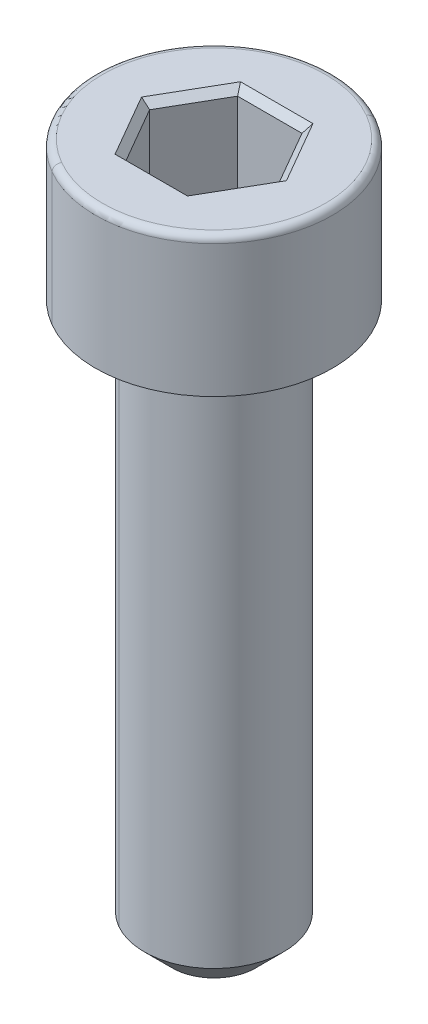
ISO-10303-21;
HEADER;
FILE_DESCRIPTION(('STEP AP214'),'2;1');
FILE_NAME('part.step','',(''),(''),'','','');
FILE_SCHEMA(('AUTOMOTIVE_DESIGN { 1 0 10303 214 1 1 1 1 }'));
ENDSEC;
DATA;
#1=APPLICATION_CONTEXT('core data for automotive mechanical design processes');
#2=APPLICATION_PROTOCOL_DEFINITION('international standard','automotive_design',2000,#1);
#3=PRODUCT_CONTEXT('',#1,'mechanical');
#4=PRODUCT('Part','Part','',(#3));
#5=PRODUCT_RELATED_PRODUCT_CATEGORY('part','',(#4));
#6=PRODUCT_DEFINITION_FORMATION('','',#4);
#7=PRODUCT_DEFINITION_CONTEXT('part definition',#1,'design');
#8=PRODUCT_DEFINITION('design','',#6,#7);
#9=PRODUCT_DEFINITION_SHAPE('','',#8);
#10=(LENGTH_UNIT() NAMED_UNIT(*) SI_UNIT(.MILLI.,.METRE.));
#11=(NAMED_UNIT(*) PLANE_ANGLE_UNIT() SI_UNIT($,.RADIAN.));
#12=(NAMED_UNIT(*) SI_UNIT($,.STERADIAN.) SOLID_ANGLE_UNIT());
#13=UNCERTAINTY_MEASURE_WITH_UNIT(LENGTH_MEASURE(1.E-05),#10,'distance_accuracy_value','');
#14=(GEOMETRIC_REPRESENTATION_CONTEXT(3) GLOBAL_UNCERTAINTY_ASSIGNED_CONTEXT((#13)) GLOBAL_UNIT_ASSIGNED_CONTEXT((#10,
#11,#12)) REPRESENTATION_CONTEXT('',''));
#15=CARTESIAN_POINT('',(0.,0.,0.));
#16=DIRECTION('',(0.,0.,1.));
#17=DIRECTION('',(1.,0.,0.));
#18=AXIS2_PLACEMENT_3D('',#15,#16,#17);
#19=CARTESIAN_POINT('',(-29.1547005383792,14.75,6.5));
#20=DIRECTION('',(-0.612372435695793,-0.70710678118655,-0.353553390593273));
#21=DIRECTION('',(-0.5,0.,0.866025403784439));
#22=AXIS2_PLACEMENT_3D('',#19,#20,#21);
#23=PLANE('',#22);
#24=DIRECTION('',(-0.377964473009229,0.654653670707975,-0.654653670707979));
#25=VECTOR('',#24,1.);
#26=CARTESIAN_POINT('',(-29.1547005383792,14.75,6.5));
#27=LINE('',#26,#25);
#28=CARTESIAN_POINT('',(-29.1547005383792,14.75,6.5));
#29=VERTEX_POINT('',#28);
#30=CARTESIAN_POINT('',(-29.2990381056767,15.,6.25));
#31=VERTEX_POINT('',#30);
#32=EDGE_CURVE('E25',#29,#31,#27,.T.);
#33=ORIENTED_EDGE('',*,*,#32,.T.);
#34=DIRECTION('',(0.5,0.,-0.866025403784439));
#35=VECTOR('',#34,1.);
#36=CARTESIAN_POINT('',(-29.948557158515,15.,7.375));
#37=LINE('',#36,#35);
#38=CARTESIAN_POINT('',(-30.5980762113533,15.,8.5));
#39=VERTEX_POINT('',#38);
#40=EDGE_CURVE('E237',#39,#31,#37,.T.);
#41=ORIENTED_EDGE('',*,*,#40,.F.);
#42=DIRECTION('',(0.755928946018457,-0.654653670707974,0.));
#43=VECTOR('',#42,1.);
#44=CARTESIAN_POINT('',(-29.6495721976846,14.1785714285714,8.5));
#45=LINE('',#44,#43);
#46=CARTESIAN_POINT('',(-30.3094010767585,14.75,8.5));
#47=VERTEX_POINT('',#46);
#48=EDGE_CURVE('E11',#39,#47,#45,.T.);
#49=ORIENTED_EDGE('',*,*,#48,.T.);
#50=DIRECTION('',(-0.5,0.,0.866025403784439));
#51=VECTOR('',#50,1.);
#52=CARTESIAN_POINT('',(-29.1547005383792,14.75,6.5));
#53=LINE('',#52,#51);
#54=EDGE_CURVE('E266',#29,#47,#53,.T.);
#55=ORIENTED_EDGE('',*,*,#54,.F.);
#56=EDGE_LOOP('',(#33,#41,#49,#55));
#57=FACE_BOUND('',#56,.T.);
#58=ADVANCED_FACE('F16',(#57),#23,.F.);
#59=CARTESIAN_POINT('',(-30.3094010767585,14.75,8.5));
#60=DIRECTION('',(-0.612372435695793,-0.70710678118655,0.353553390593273));
#61=DIRECTION('',(0.5,0.,0.866025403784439));
#62=AXIS2_PLACEMENT_3D('',#59,#60,#61);
#63=PLANE('',#62);
#64=DIRECTION('',(0.377964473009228,-0.654653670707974,-0.65465367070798));
#65=VECTOR('',#64,1.);
#66=CARTESIAN_POINT('',(-29.1547005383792,14.75,10.5));
#67=LINE('',#66,#65);
#68=CARTESIAN_POINT('',(-29.2990381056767,15.,10.75));
#69=VERTEX_POINT('',#68);
#70=CARTESIAN_POINT('',(-29.1547005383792,14.75,10.5));
#71=VERTEX_POINT('',#70);
#72=EDGE_CURVE('E284',#69,#71,#67,.T.);
#73=ORIENTED_EDGE('',*,*,#72,.T.);
#74=DIRECTION('',(0.5,0.,0.866025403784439));
#75=VECTOR('',#74,1.);
#76=CARTESIAN_POINT('',(-30.3094010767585,14.75,8.5));
#77=LINE('',#76,#75);
#78=EDGE_CURVE('E326',#47,#71,#77,.T.);
#79=ORIENTED_EDGE('',*,*,#78,.F.);
#80=ORIENTED_EDGE('',*,*,#48,.F.);
#81=DIRECTION('',(-0.5,0.,-0.866025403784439));
#82=VECTOR('',#81,1.);
#83=CARTESIAN_POINT('',(-29.948557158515,15.,9.625));
#84=LINE('',#83,#82);
#85=EDGE_CURVE('E233',#69,#39,#84,.T.);
#86=ORIENTED_EDGE('',*,*,#85,.F.);
#87=EDGE_LOOP('',(#73,#79,#80,#86));
#88=FACE_BOUND('',#87,.T.);
#89=ADVANCED_FACE('F354',(#88),#63,.F.);
#90=CARTESIAN_POINT('',(-26.8452994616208,14.75,6.5));
#91=DIRECTION('',(0.,-0.70710678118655,-0.707106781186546));
#92=DIRECTION('',(-1.,0.,0.));
#93=AXIS2_PLACEMENT_3D('',#90,#91,#92);
#94=PLANE('',#93);
#95=DIRECTION('',(0.377964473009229,0.654653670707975,-0.654653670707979));
#96=VECTOR('',#95,1.);
#97=CARTESIAN_POINT('',(-26.8452994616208,14.75,6.5));
#98=LINE('',#97,#96);
#99=CARTESIAN_POINT('',(-26.8452994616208,14.75,6.5));
#100=VERTEX_POINT('',#99);
#101=CARTESIAN_POINT('',(-26.7009618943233,15.,6.25));
#102=VERTEX_POINT('',#101);
#103=EDGE_CURVE('E277',#100,#102,#98,.T.);
#104=ORIENTED_EDGE('',*,*,#103,.T.);
#105=DIRECTION('',(1.,0.,0.));
#106=VECTOR('',#105,1.);
#107=CARTESIAN_POINT('',(-28.,15.,6.25));
#108=LINE('',#107,#106);
#109=EDGE_CURVE('E241',#31,#102,#108,.T.);
#110=ORIENTED_EDGE('',*,*,#109,.F.);
#111=ORIENTED_EDGE('',*,*,#32,.F.);
#112=DIRECTION('',(-1.,0.,0.));
#113=VECTOR('',#112,1.);
#114=CARTESIAN_POINT('',(-26.8452994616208,14.75,6.5));
#115=LINE('',#114,#113);
#116=EDGE_CURVE('E288',#100,#29,#115,.T.);
#117=ORIENTED_EDGE('',*,*,#116,.F.);
#118=EDGE_LOOP('',(#104,#110,#111,#117));
#119=FACE_BOUND('',#118,.T.);
#120=ADVANCED_FACE('F359',(#119),#94,.F.);
#121=CARTESIAN_POINT('',(-29.1547005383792,14.75,10.5));
#122=DIRECTION('',(0.,-0.70710678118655,0.707106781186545));
#123=DIRECTION('',(1.,0.,0.));
#124=AXIS2_PLACEMENT_3D('',#121,#122,#123);
#125=PLANE('',#124);
#126=DIRECTION('',(-0.377964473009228,-0.654653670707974,-0.654653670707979));
#127=VECTOR('',#126,1.);
#128=CARTESIAN_POINT('',(-26.8452994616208,14.75,10.5));
#129=LINE('',#128,#127);
#130=CARTESIAN_POINT('',(-26.7009618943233,15.,10.75));
#131=VERTEX_POINT('',#130);
#132=CARTESIAN_POINT('',(-26.8452994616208,14.75,10.5));
#133=VERTEX_POINT('',#132);
#134=EDGE_CURVE('E200',#131,#133,#129,.T.);
#135=ORIENTED_EDGE('',*,*,#134,.T.);
#136=DIRECTION('',(1.,0.,0.));
#137=VECTOR('',#136,1.);
#138=CARTESIAN_POINT('',(-29.1547005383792,14.75,10.5));
#139=LINE('',#138,#137);
#140=EDGE_CURVE('E318',#71,#133,#139,.T.);
#141=ORIENTED_EDGE('',*,*,#140,.F.);
#142=ORIENTED_EDGE('',*,*,#72,.F.);
#143=DIRECTION('',(-1.,0.,0.));
#144=VECTOR('',#143,1.);
#145=CARTESIAN_POINT('',(-28.,15.,10.75));
#146=LINE('',#145,#144);
#147=EDGE_CURVE('E252',#131,#69,#146,.T.);
#148=ORIENTED_EDGE('',*,*,#147,.F.);
#149=EDGE_LOOP('',(#135,#141,#142,#148));
#150=FACE_BOUND('',#149,.T.);
#151=ADVANCED_FACE('F553',(#150),#125,.F.);
#152=CARTESIAN_POINT('',(-25.6905989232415,14.75,8.5));
#153=DIRECTION('',(0.612372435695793,-0.70710678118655,-0.353553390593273));
#154=DIRECTION('',(-0.5,0.,-0.866025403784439));
#155=AXIS2_PLACEMENT_3D('',#152,#153,#154);
#156=PLANE('',#155);
#157=DIRECTION('',(0.755928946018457,0.654653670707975,0.));
#158=VECTOR('',#157,1.);
#159=CARTESIAN_POINT('',(-25.6905989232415,14.75,8.5));
#160=LINE('',#159,#158);
#161=CARTESIAN_POINT('',(-25.6905989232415,14.75,8.5));
#162=VERTEX_POINT('',#161);
#163=CARTESIAN_POINT('',(-25.4019237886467,15.,8.5));
#164=VERTEX_POINT('',#163);
#165=EDGE_CURVE('E206',#162,#164,#160,.T.);
#166=ORIENTED_EDGE('',*,*,#165,.T.);
#167=DIRECTION('',(0.5,0.,0.866025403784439));
#168=VECTOR('',#167,1.);
#169=CARTESIAN_POINT('',(-26.051442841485,15.,7.375));
#170=LINE('',#169,#168);
#171=EDGE_CURVE('E245',#102,#164,#170,.T.);
#172=ORIENTED_EDGE('',*,*,#171,.F.);
#173=ORIENTED_EDGE('',*,*,#103,.F.);
#174=DIRECTION('',(-0.5,0.,-0.866025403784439));
#175=VECTOR('',#174,1.);
#176=CARTESIAN_POINT('',(-25.6905989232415,14.75,8.5));
#177=LINE('',#176,#175);
#178=EDGE_CURVE('E297',#162,#100,#177,.T.);
#179=ORIENTED_EDGE('',*,*,#178,.F.);
#180=EDGE_LOOP('',(#166,#172,#173,#179));
#181=FACE_BOUND('',#180,.T.);
#182=ADVANCED_FACE('F350',(#181),#156,.F.);
#183=CARTESIAN_POINT('',(-26.8452994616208,14.75,10.5));
#184=DIRECTION('',(0.612372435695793,-0.70710678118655,0.353553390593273));
#185=DIRECTION('',(0.5,0.,-0.866025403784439));
#186=AXIS2_PLACEMENT_3D('',#183,#184,#185);
#187=PLANE('',#186);
#188=ORIENTED_EDGE('',*,*,#134,.F.);
#189=DIRECTION('',(-0.5,0.,0.866025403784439));
#190=VECTOR('',#189,1.);
#191=CARTESIAN_POINT('',(-26.051442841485,15.,9.625));
#192=LINE('',#191,#190);
#193=EDGE_CURVE('E249',#164,#131,#192,.T.);
#194=ORIENTED_EDGE('',*,*,#193,.F.);
#195=ORIENTED_EDGE('',*,*,#165,.F.);
#196=DIRECTION('',(0.5,0.,-0.866025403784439));
#197=VECTOR('',#196,1.);
#198=CARTESIAN_POINT('',(-26.8452994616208,14.75,10.5));
#199=LINE('',#198,#197);
#200=EDGE_CURVE('E309',#133,#162,#199,.T.);
#201=ORIENTED_EDGE('',*,*,#200,.F.);
#202=EDGE_LOOP('',(#188,#194,#195,#201));
#203=FACE_BOUND('',#202,.T.);
#204=ADVANCED_FACE('F342',(#203),#187,.F.);
#205=CARTESIAN_POINT('',(-27.0618058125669,11.75,6.625));
#206=DIRECTION('',(-0.5,0.,-0.866025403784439));
#207=DIRECTION('',(0.866025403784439,0.,-0.5));
#208=AXIS2_PLACEMENT_3D('',#205,#206,#207);
#209=CYLINDRICAL_SURFACE('',#208,0.25);
#210=CARTESIAN_POINT('',(-25.9792740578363,11.5,8.5));
#211=CARTESIAN_POINT('',(-25.8101720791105,11.5,8.5));
#212=CARTESIAN_POINT('',(-25.6905989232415,11.6035533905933,8.5));
#213=CARTESIAN_POINT('',(-25.6905989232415,11.75,8.5));
#214=(BOUNDED_CURVE() B_SPLINE_CURVE(3,(#210,#211,#212,#213),.UNSPECIFIED.,.F.,
.F.) B_SPLINE_CURVE_WITH_KNOTS((4,4),(1.5707963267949,3.1415926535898),
.UNSPECIFIED.) CURVE() GEOMETRIC_REPRESENTATION_ITEM() RATIONAL_B_SPLINE_CURVE((1.,
0.804737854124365,0.804737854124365,1.)) REPRESENTATION_ITEM(''));
#215=CARTESIAN_POINT('',(-25.9792740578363,11.5,8.5));
#216=VERTEX_POINT('',#215);
#217=CARTESIAN_POINT('',(-25.6905989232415,11.75,8.5));
#218=VERTEX_POINT('',#217);
#219=EDGE_CURVE('E136',#216,#218,#214,.T.);
#220=ORIENTED_EDGE('',*,*,#219,.T.);
#221=DIRECTION('',(0.5,0.,0.866025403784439));
#222=VECTOR('',#221,1.);
#223=CARTESIAN_POINT('',(-25.6905989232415,11.75,8.5));
#224=LINE('',#223,#222);
#225=CARTESIAN_POINT('',(-26.8452994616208,11.75,6.5));
#226=VERTEX_POINT('',#225);
#227=EDGE_CURVE('E301',#226,#218,#224,.T.);
#228=ORIENTED_EDGE('',*,*,#227,.F.);
#229=CARTESIAN_POINT('',(-26.8452994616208,11.75,6.5));
#230=CARTESIAN_POINT('',(-26.8452994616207,11.6035533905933,6.5));
#231=CARTESIAN_POINT('',(-26.9050860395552,11.5,6.60355339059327));
#232=CARTESIAN_POINT('',(-26.9896370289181,11.5,6.75));
#233=(BOUNDED_CURVE() B_SPLINE_CURVE(3,(#229,#230,#231,#232),.UNSPECIFIED.,.F.,
.F.) B_SPLINE_CURVE_WITH_KNOTS((4,4),(0.,1.5707963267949),
.UNSPECIFIED.) CURVE() GEOMETRIC_REPRESENTATION_ITEM() RATIONAL_B_SPLINE_CURVE((1.,
0.804737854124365,0.804737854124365,1.)) REPRESENTATION_ITEM(''));
#234=CARTESIAN_POINT('',(-26.9896370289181,11.5,6.75));
#235=VERTEX_POINT('',#234);
#236=EDGE_CURVE('E191',#226,#235,#233,.T.);
#237=ORIENTED_EDGE('',*,*,#236,.T.);
#238=DIRECTION('',(-0.5,0.,-0.866025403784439));
#239=VECTOR('',#238,1.);
#240=CARTESIAN_POINT('',(-27.0618058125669,11.5,6.625));
#241=LINE('',#240,#239);
#242=EDGE_CURVE('E151',#216,#235,#241,.T.);
#243=ORIENTED_EDGE('',*,*,#242,.F.);
#244=EDGE_LOOP('',(#220,#228,#237,#243));
#245=FACE_BOUND('',#244,.T.);
#246=ADVANCED_FACE('F340',(#245),#209,.F.);
#247=CARTESIAN_POINT('',(-30.3094010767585,11.75,6.75));
#248=DIRECTION('',(-1.,0.,0.));
#249=DIRECTION('',(0.,0.,-1.));
#250=AXIS2_PLACEMENT_3D('',#247,#248,#249);
#251=CYLINDRICAL_SURFACE('',#250,0.25);
#252=CARTESIAN_POINT('',(-29.1547005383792,11.75,6.5));
#253=CARTESIAN_POINT('',(-29.1547005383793,11.6035533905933,6.5));
#254=CARTESIAN_POINT('',(-29.0949139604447,11.5,6.60355339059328));
#255=CARTESIAN_POINT('',(-29.0103629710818,11.5,6.75));
#256=(BOUNDED_CURVE() B_SPLINE_CURVE(3,(#252,#253,#254,#255),.UNSPECIFIED.,.F.,
.F.) B_SPLINE_CURVE_WITH_KNOTS((4,4),(0.,1.5707963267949),
.UNSPECIFIED.) CURVE() GEOMETRIC_REPRESENTATION_ITEM() RATIONAL_B_SPLINE_CURVE((1.,
0.804737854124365,0.804737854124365,1.)) REPRESENTATION_ITEM(''));
#257=CARTESIAN_POINT('',(-29.1547005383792,11.75,6.5));
#258=VERTEX_POINT('',#257);
#259=CARTESIAN_POINT('',(-29.0103629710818,11.5,6.75));
#260=VERTEX_POINT('',#259);
#261=EDGE_CURVE('E124',#258,#260,#256,.T.);
#262=ORIENTED_EDGE('',*,*,#261,.T.);
#263=DIRECTION('',(-1.,0.,0.));
#264=VECTOR('',#263,1.);
#265=CARTESIAN_POINT('',(-30.3094010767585,11.5,6.75));
#266=LINE('',#265,#264);
#267=EDGE_CURVE('E128',#235,#260,#266,.T.);
#268=ORIENTED_EDGE('',*,*,#267,.F.);
#269=ORIENTED_EDGE('',*,*,#236,.F.);
#270=DIRECTION('',(1.,0.,0.));
#271=VECTOR('',#270,1.);
#272=CARTESIAN_POINT('',(-26.8452994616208,11.75,6.5));
#273=LINE('',#272,#271);
#274=EDGE_CURVE('E131',#258,#226,#273,.T.);
#275=ORIENTED_EDGE('',*,*,#274,.F.);
#276=EDGE_LOOP('',(#262,#268,#269,#275));
#277=FACE_BOUND('',#276,.T.);
#278=ADVANCED_FACE('F126',(#277),#251,.F.);
#279=CARTESIAN_POINT('',(-27.0618058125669,11.75,10.375));
#280=DIRECTION('',(0.5,0.,-0.866025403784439));
#281=DIRECTION('',(0.866025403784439,0.,0.5));
#282=AXIS2_PLACEMENT_3D('',#279,#280,#281);
#283=CYLINDRICAL_SURFACE('',#282,0.25);
#284=CARTESIAN_POINT('',(-26.9896370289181,11.5,10.25));
#285=CARTESIAN_POINT('',(-26.9050860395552,11.5,10.3964466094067));
#286=CARTESIAN_POINT('',(-26.8452994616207,11.6035533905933,10.5));
#287=CARTESIAN_POINT('',(-26.8452994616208,11.75,10.5));
#288=(BOUNDED_CURVE() B_SPLINE_CURVE(3,(#284,#285,#286,#287),.UNSPECIFIED.,.F.,
.F.) B_SPLINE_CURVE_WITH_KNOTS((4,4),(4.71238898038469,6.28318530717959),
.UNSPECIFIED.) CURVE() GEOMETRIC_REPRESENTATION_ITEM() RATIONAL_B_SPLINE_CURVE((1.,
0.804737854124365,0.804737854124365,1.)) REPRESENTATION_ITEM(''));
#289=CARTESIAN_POINT('',(-26.9896370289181,11.5,10.25));
#290=VERTEX_POINT('',#289);
#291=CARTESIAN_POINT('',(-26.8452994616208,11.75,10.5));
#292=VERTEX_POINT('',#291);
#293=EDGE_CURVE('E137',#290,#292,#288,.T.);
#294=ORIENTED_EDGE('',*,*,#293,.T.);
#295=DIRECTION('',(-0.5,0.,0.866025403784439));
#296=VECTOR('',#295,1.);
#297=CARTESIAN_POINT('',(-26.8452994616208,11.75,10.5));
#298=LINE('',#297,#296);
#299=EDGE_CURVE('E310',#218,#292,#298,.T.);
#300=ORIENTED_EDGE('',*,*,#299,.F.);
#301=ORIENTED_EDGE('',*,*,#219,.F.);
#302=DIRECTION('',(0.5,0.,-0.866025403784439));
#303=VECTOR('',#302,1.);
#304=CARTESIAN_POINT('',(-27.0618058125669,11.5,10.375));
#305=LINE('',#304,#303);
#306=EDGE_CURVE('E157',#290,#216,#305,.T.);
#307=ORIENTED_EDGE('',*,*,#306,.F.);
#308=EDGE_LOOP('',(#294,#300,#301,#307));
#309=FACE_BOUND('',#308,.T.);
#310=ADVANCED_FACE('F338',(#309),#283,.F.);
#311=CARTESIAN_POINT('',(-30.0928947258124,11.75,8.625));
#312=DIRECTION('',(-0.5,0.,0.866025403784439));
#313=DIRECTION('',(0.,-1.,0.));
#314=AXIS2_PLACEMENT_3D('',#311,#312,#313);
#315=CYLINDRICAL_SURFACE('',#314,0.25);
#316=CARTESIAN_POINT('',(-30.3094010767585,11.75,8.5));
#317=CARTESIAN_POINT('',(-30.3094010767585,11.6035533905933,8.5));
#318=CARTESIAN_POINT('',(-30.1898279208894,11.5,8.5));
#319=CARTESIAN_POINT('',(-30.0207259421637,11.5,8.5));
#320=(BOUNDED_CURVE() B_SPLINE_CURVE(3,(#316,#317,#318,#319),.UNSPECIFIED.,.F.,
.F.) B_SPLINE_CURVE_WITH_KNOTS((4,4),(0.,1.5707963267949),
.UNSPECIFIED.) CURVE() GEOMETRIC_REPRESENTATION_ITEM() RATIONAL_B_SPLINE_CURVE((1.,
0.804737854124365,0.804737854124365,1.)) REPRESENTATION_ITEM(''));
#321=CARTESIAN_POINT('',(-30.3094010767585,11.75,8.5));
#322=VERTEX_POINT('',#321);
#323=CARTESIAN_POINT('',(-30.0207259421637,11.5,8.5));
#324=VERTEX_POINT('',#323);
#325=EDGE_CURVE('E142',#322,#324,#320,.T.);
#326=ORIENTED_EDGE('',*,*,#325,.T.);
#327=DIRECTION('',(-0.5,0.,0.866025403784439));
#328=VECTOR('',#327,1.);
#329=CARTESIAN_POINT('',(-30.0928947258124,11.5,8.625));
#330=LINE('',#329,#328);
#331=EDGE_CURVE('E140',#260,#324,#330,.T.);
#332=ORIENTED_EDGE('',*,*,#331,.F.);
#333=ORIENTED_EDGE('',*,*,#261,.F.);
#334=DIRECTION('',(0.5,0.,-0.866025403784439));
#335=VECTOR('',#334,1.);
#336=CARTESIAN_POINT('',(-29.1547005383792,11.75,6.5));
#337=LINE('',#336,#335);
#338=EDGE_CURVE('E274',#322,#258,#337,.T.);
#339=ORIENTED_EDGE('',*,*,#338,.F.);
#340=EDGE_LOOP('',(#326,#332,#333,#339));
#341=FACE_BOUND('',#340,.T.);
#342=ADVANCED_FACE('F141',(#341),#315,.F.);
#343=CARTESIAN_POINT('',(-30.3094010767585,11.75,10.25));
#344=DIRECTION('',(1.,0.,0.));
#345=DIRECTION('',(0.,0.,1.));
#346=AXIS2_PLACEMENT_3D('',#343,#344,#345);
#347=CYLINDRICAL_SURFACE('',#346,0.25);
#348=CARTESIAN_POINT('',(-29.0103629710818,11.5,10.25));
#349=CARTESIAN_POINT('',(-29.0949139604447,11.5,10.3964466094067));
#350=CARTESIAN_POINT('',(-29.1547005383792,11.6035533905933,10.5));
#351=CARTESIAN_POINT('',(-29.1547005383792,11.75,10.5));
#352=(BOUNDED_CURVE() B_SPLINE_CURVE(3,(#348,#349,#350,#351),.UNSPECIFIED.,.F.,
.F.) B_SPLINE_CURVE_WITH_KNOTS((4,4),(4.71238898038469,6.28318530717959),
.UNSPECIFIED.) CURVE() GEOMETRIC_REPRESENTATION_ITEM() RATIONAL_B_SPLINE_CURVE((1.,
0.804737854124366,0.804737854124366,1.)) REPRESENTATION_ITEM(''));
#353=CARTESIAN_POINT('',(-29.0103629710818,11.5,10.25));
#354=VERTEX_POINT('',#353);
#355=CARTESIAN_POINT('',(-29.1547005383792,11.75,10.5));
#356=VERTEX_POINT('',#355);
#357=EDGE_CURVE('E37',#354,#356,#352,.T.);
#358=ORIENTED_EDGE('',*,*,#357,.T.);
#359=DIRECTION('',(-1.,0.,0.));
#360=VECTOR('',#359,1.);
#361=CARTESIAN_POINT('',(-29.1547005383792,11.75,10.5));
#362=LINE('',#361,#360);
#363=EDGE_CURVE('E322',#292,#356,#362,.T.);
#364=ORIENTED_EDGE('',*,*,#363,.F.);
#365=ORIENTED_EDGE('',*,*,#293,.F.);
#366=DIRECTION('',(1.,0.,0.));
#367=VECTOR('',#366,1.);
#368=CARTESIAN_POINT('',(-30.3094010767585,11.5,10.25));
#369=LINE('',#368,#367);
#370=EDGE_CURVE('E164',#354,#290,#369,.T.);
#371=ORIENTED_EDGE('',*,*,#370,.F.);
#372=EDGE_LOOP('',(#358,#364,#365,#371));
#373=FACE_BOUND('',#372,.T.);
#374=ADVANCED_FACE('F572',(#373),#347,.F.);
#375=CARTESIAN_POINT('',(-30.0928947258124,11.75,8.375));
#376=DIRECTION('',(0.5,0.,0.866025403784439));
#377=DIRECTION('',(-0.866025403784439,0.,0.5));
#378=AXIS2_PLACEMENT_3D('',#375,#376,#377);
#379=CYLINDRICAL_SURFACE('',#378,0.25);
#380=ORIENTED_EDGE('',*,*,#325,.F.);
#381=DIRECTION('',(-0.5,0.,-0.866025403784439));
#382=VECTOR('',#381,1.);
#383=CARTESIAN_POINT('',(-30.3094010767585,11.75,8.5));
#384=LINE('',#383,#382);
#385=EDGE_CURVE('E329',#356,#322,#384,.T.);
#386=ORIENTED_EDGE('',*,*,#385,.F.);
#387=ORIENTED_EDGE('',*,*,#357,.F.);
#388=DIRECTION('',(0.5,0.,0.866025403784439));
#389=VECTOR('',#388,1.);
#390=CARTESIAN_POINT('',(-30.0928947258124,11.5,8.375));
#391=LINE('',#390,#389);
#392=EDGE_CURVE('E146',#324,#354,#391,.T.);
#393=ORIENTED_EDGE('',*,*,#392,.F.);
#394=EDGE_LOOP('',(#380,#386,#387,#393));
#395=FACE_BOUND('',#394,.T.);
#396=ADVANCED_FACE('F569',(#395),#379,.F.);
#397=CARTESIAN_POINT('',(-28.,14.75,8.5));
#398=DIRECTION('',(0.,-1.,0.));
#399=DIRECTION('',(0.5,0.,-0.866025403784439));
#400=AXIS2_PLACEMENT_3D('',#397,#398,#399);
#401=TOROIDAL_SURFACE('',#400,4.,0.25);
#402=CARTESIAN_POINT('',(-30.,14.75,11.9641016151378));
#403=DIRECTION('',(0.866025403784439,0.,0.5));
#404=DIRECTION('',(-0.5,0.,0.866025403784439));
#405=AXIS2_PLACEMENT_3D('',#402,#403,#404);
#406=CIRCLE('',#405,0.25);
#407=CARTESIAN_POINT('',(-30.,15.,11.9641016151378));
#408=VERTEX_POINT('',#407);
#409=CARTESIAN_POINT('',(-30.125,14.75,12.1806079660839));
#410=VERTEX_POINT('',#409);
#411=EDGE_CURVE('E464',#408,#410,#406,.T.);
#412=ORIENTED_EDGE('',*,*,#411,.F.);
#413=CARTESIAN_POINT('',(-28.,15.,8.5));
#414=DIRECTION('',(0.,1.,0.));
#415=DIRECTION('',(0.5,0.,-0.866025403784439));
#416=AXIS2_PLACEMENT_3D('',#413,#414,#415);
#417=CIRCLE('',#416,4.);
#418=CARTESIAN_POINT('',(-26.,15.,5.03589838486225));
#419=VERTEX_POINT('',#418);
#420=EDGE_CURVE('E228',#419,#408,#417,.T.);
#421=ORIENTED_EDGE('',*,*,#420,.F.);
#422=CARTESIAN_POINT('',(-26.,14.75,5.03589838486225));
#423=DIRECTION('',(-0.866025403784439,0.,-0.5));
#424=DIRECTION('',(0.,1.,0.));
#425=AXIS2_PLACEMENT_3D('',#422,#423,#424);
#426=CIRCLE('',#425,0.25);
#427=CARTESIAN_POINT('',(-25.875,14.75,4.81939203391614));
#428=VERTEX_POINT('',#427);
#429=EDGE_CURVE('E472',#419,#428,#426,.T.);
#430=ORIENTED_EDGE('',*,*,#429,.T.);
#431=CARTESIAN_POINT('',(-28.,14.75,8.5));
#432=DIRECTION('',(0.,-1.,0.));
#433=DIRECTION('',(0.5,0.,-0.866025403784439));
#434=AXIS2_PLACEMENT_3D('',#431,#432,#433);
#435=CIRCLE('',#434,4.25);
#436=EDGE_CURVE('E225',#410,#428,#435,.T.);
#437=ORIENTED_EDGE('',*,*,#436,.F.);
#438=EDGE_LOOP('',(#412,#421,#430,#437));
#439=FACE_BOUND('',#438,.T.);
#440=ADVANCED_FACE('F465',(#439),#401,.T.);
#441=CARTESIAN_POINT('',(-28.,-10.,8.5));
#442=DIRECTION('',(0.,1.,0.));
#443=DIRECTION('',(-0.5,0.,0.866025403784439));
#444=AXIS2_PLACEMENT_3D('',#441,#442,#443);
#445=CONICAL_SURFACE('',#444,1.5,0.785398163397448);
#446=DIRECTION('',(0.353553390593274,0.707106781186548,-0.612372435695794));
#447=VECTOR('',#446,1.);
#448=CARTESIAN_POINT('',(-27.25,-10.,7.20096189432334));
#449=LINE('',#448,#447);
#450=CARTESIAN_POINT('',(-27.25,-10.,7.20096189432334));
#451=VERTEX_POINT('',#450);
#452=CARTESIAN_POINT('',(-26.75,-9.,6.3349364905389));
#453=VERTEX_POINT('',#452);
#454=EDGE_CURVE('E496',#451,#453,#449,.T.);
#455=ORIENTED_EDGE('',*,*,#454,.F.);
#456=CARTESIAN_POINT('',(-28.,-10.,8.5));
#457=DIRECTION('',(0.,-1.,0.));
#458=DIRECTION('',(0.5,0.,-0.866025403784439));
#459=AXIS2_PLACEMENT_3D('',#456,#457,#458);
#460=CIRCLE('',#459,1.5);
#461=CARTESIAN_POINT('',(-28.75,-10.,9.79903810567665));
#462=VERTEX_POINT('',#461);
#463=EDGE_CURVE('E214',#462,#451,#460,.T.);
#464=ORIENTED_EDGE('',*,*,#463,.F.);
#465=DIRECTION('',(-0.353553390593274,0.707106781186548,0.612372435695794));
#466=VECTOR('',#465,1.);
#467=CARTESIAN_POINT('',(-28.75,-10.,9.79903810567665));
#468=LINE('',#467,#466);
#469=CARTESIAN_POINT('',(-29.25,-9.,10.6650635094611));
#470=VERTEX_POINT('',#469);
#471=EDGE_CURVE('E504',#462,#470,#468,.T.);
#472=ORIENTED_EDGE('',*,*,#471,.T.);
#473=CARTESIAN_POINT('',(-28.,-9.,8.5));
#474=DIRECTION('',(0.,1.,0.));
#475=DIRECTION('',(0.5,0.,-0.866025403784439));
#476=AXIS2_PLACEMENT_3D('',#473,#474,#475);
#477=CIRCLE('',#476,2.5);
#478=EDGE_CURVE('E212',#453,#470,#477,.T.);
#479=ORIENTED_EDGE('',*,*,#478,.F.);
#480=EDGE_LOOP('',(#455,#464,#472,#479));
#481=FACE_BOUND('',#480,.T.);
#482=ADVANCED_FACE('F532',(#481),#445,.T.);
#483=CARTESIAN_POINT('',(-30.3094010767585,11.5,8.5));
#484=DIRECTION('',(0.,1.,0.));
#485=DIRECTION('',(-0.866025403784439,0.,-0.5));
#486=AXIS2_PLACEMENT_3D('',#483,#484,#485);
#487=PLANE('',#486);
#488=ORIENTED_EDGE('',*,*,#306,.T.);
#489=ORIENTED_EDGE('',*,*,#242,.T.);
#490=ORIENTED_EDGE('',*,*,#267,.T.);
#491=ORIENTED_EDGE('',*,*,#331,.T.);
#492=ORIENTED_EDGE('',*,*,#392,.T.);
#493=ORIENTED_EDGE('',*,*,#370,.T.);
#494=EDGE_LOOP('',(#488,#489,#490,#491,#492,#493));
#495=FACE_BOUND('',#494,.T.);
#496=ADVANCED_FACE('F149',(#495),#487,.T.);
#497=CARTESIAN_POINT('',(-30.3094010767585,11.5,8.5));
#498=DIRECTION('',(-0.866025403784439,0.,0.5));
#499=DIRECTION('',(0.5,0.,0.866025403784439));
#500=AXIS2_PLACEMENT_3D('',#497,#498,#499);
#501=PLANE('',#500);
#502=DIRECTION('',(0.,1.,0.));
#503=VECTOR('',#502,1.);
#504=CARTESIAN_POINT('',(-30.3094010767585,11.5,8.5));
#505=LINE('',#504,#503);
#506=EDGE_CURVE('E270',#322,#47,#505,.T.);
#507=ORIENTED_EDGE('',*,*,#506,.T.);
#508=ORIENTED_EDGE('',*,*,#78,.T.);
#509=DIRECTION('',(0.,1.,0.));
#510=VECTOR('',#509,1.);
#511=CARTESIAN_POINT('',(-29.1547005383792,11.5,10.5));
#512=LINE('',#511,#510);
#513=EDGE_CURVE('E314',#356,#71,#512,.T.);
#514=ORIENTED_EDGE('',*,*,#513,.F.);
#515=ORIENTED_EDGE('',*,*,#385,.T.);
#516=EDGE_LOOP('',(#507,#508,#514,#515));
#517=FACE_BOUND('',#516,.T.);
#518=ADVANCED_FACE('F380',(#517),#501,.F.);
#519=CARTESIAN_POINT('',(-29.1547005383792,11.5,10.5));
#520=DIRECTION('',(0.,0.,1.));
#521=DIRECTION('',(0.,-1.,0.));
#522=AXIS2_PLACEMENT_3D('',#519,#520,#521);
#523=PLANE('',#522);
#524=ORIENTED_EDGE('',*,*,#513,.T.);
#525=ORIENTED_EDGE('',*,*,#140,.T.);
#526=DIRECTION('',(0.,1.,0.));
#527=VECTOR('',#526,1.);
#528=CARTESIAN_POINT('',(-26.8452994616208,11.5,10.5));
#529=LINE('',#528,#527);
#530=EDGE_CURVE('E305',#292,#133,#529,.T.);
#531=ORIENTED_EDGE('',*,*,#530,.F.);
#532=ORIENTED_EDGE('',*,*,#363,.T.);
#533=EDGE_LOOP('',(#524,#525,#531,#532));
#534=FACE_BOUND('',#533,.T.);
#535=ADVANCED_FACE('F561',(#534),#523,.F.);
#536=CARTESIAN_POINT('',(-26.8452994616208,11.5,10.5));
#537=DIRECTION('',(0.866025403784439,0.,0.5));
#538=DIRECTION('',(0.5,0.,-0.866025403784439));
#539=AXIS2_PLACEMENT_3D('',#536,#537,#538);
#540=PLANE('',#539);
#541=ORIENTED_EDGE('',*,*,#530,.T.);
#542=ORIENTED_EDGE('',*,*,#200,.T.);
#543=DIRECTION('',(0.,1.,0.));
#544=VECTOR('',#543,1.);
#545=CARTESIAN_POINT('',(-25.6905989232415,11.5,8.5));
#546=LINE('',#545,#544);
#547=EDGE_CURVE('E296',#218,#162,#546,.T.);
#548=ORIENTED_EDGE('',*,*,#547,.F.);
#549=ORIENTED_EDGE('',*,*,#299,.T.);
#550=EDGE_LOOP('',(#541,#542,#548,#549));
#551=FACE_BOUND('',#550,.T.);
#552=ADVANCED_FACE('F558',(#551),#540,.F.);
#553=CARTESIAN_POINT('',(-25.6905989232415,11.5,8.5));
#554=DIRECTION('',(0.866025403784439,0.,-0.5));
#555=DIRECTION('',(0.,1.,0.));
#556=AXIS2_PLACEMENT_3D('',#553,#554,#555);
#557=PLANE('',#556);
#558=ORIENTED_EDGE('',*,*,#547,.T.);
#559=ORIENTED_EDGE('',*,*,#178,.T.);
#560=DIRECTION('',(0.,1.,0.));
#561=VECTOR('',#560,1.);
#562=CARTESIAN_POINT('',(-26.8452994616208,11.5,6.5));
#563=LINE('',#562,#561);
#564=EDGE_CURVE('E280',#226,#100,#563,.T.);
#565=ORIENTED_EDGE('',*,*,#564,.F.);
#566=ORIENTED_EDGE('',*,*,#227,.T.);
#567=EDGE_LOOP('',(#558,#559,#565,#566));
#568=FACE_BOUND('',#567,.T.);
#569=ADVANCED_FACE('F389',(#568),#557,.F.);
#570=CARTESIAN_POINT('',(-26.8452994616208,11.5,6.5));
#571=DIRECTION('',(0.,0.,-1.));
#572=DIRECTION('',(0.,1.,0.));
#573=AXIS2_PLACEMENT_3D('',#570,#571,#572);
#574=PLANE('',#573);
#575=ORIENTED_EDGE('',*,*,#564,.T.);
#576=ORIENTED_EDGE('',*,*,#116,.T.);
#577=DIRECTION('',(0.,1.,0.));
#578=VECTOR('',#577,1.);
#579=CARTESIAN_POINT('',(-29.1547005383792,11.5,6.5));
#580=LINE('',#579,#578);
#581=EDGE_CURVE('E256',#258,#29,#580,.T.);
#582=ORIENTED_EDGE('',*,*,#581,.F.);
#583=ORIENTED_EDGE('',*,*,#274,.T.);
#584=EDGE_LOOP('',(#575,#576,#582,#583));
#585=FACE_BOUND('',#584,.T.);
#586=ADVANCED_FACE('F385',(#585),#574,.F.);
#587=CARTESIAN_POINT('',(-29.1547005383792,11.5,6.5));
#588=DIRECTION('',(-0.866025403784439,0.,-0.5));
#589=DIRECTION('',(0.,1.,0.));
#590=AXIS2_PLACEMENT_3D('',#587,#588,#589);
#591=PLANE('',#590);
#592=ORIENTED_EDGE('',*,*,#581,.T.);
#593=ORIENTED_EDGE('',*,*,#54,.T.);
#594=ORIENTED_EDGE('',*,*,#506,.F.);
#595=ORIENTED_EDGE('',*,*,#338,.T.);
#596=EDGE_LOOP('',(#592,#593,#594,#595));
#597=FACE_BOUND('',#596,.T.);
#598=ADVANCED_FACE('F382',(#597),#591,.F.);
#599=CARTESIAN_POINT('',(-28.,15.,8.5));
#600=DIRECTION('',(0.,-1.,0.));
#601=DIRECTION('',(0.5,0.,-0.866025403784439));
#602=AXIS2_PLACEMENT_3D('',#599,#600,#601);
#603=PLANE('',#602);
#604=ORIENTED_EDGE('',*,*,#85,.T.);
#605=ORIENTED_EDGE('',*,*,#40,.T.);
#606=ORIENTED_EDGE('',*,*,#109,.T.);
#607=ORIENTED_EDGE('',*,*,#171,.T.);
#608=ORIENTED_EDGE('',*,*,#193,.T.);
#609=ORIENTED_EDGE('',*,*,#147,.T.);
#610=EDGE_LOOP('',(#604,#605,#606,#607,#608,#609));
#611=FACE_BOUND('',#610,.T.);
#612=ORIENTED_EDGE('',*,*,#420,.T.);
#613=CARTESIAN_POINT('',(-28.,15.,8.5));
#614=DIRECTION('',(0.,1.,0.));
#615=DIRECTION('',(0.5,0.,-0.866025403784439));
#616=AXIS2_PLACEMENT_3D('',#613,#614,#615);
#617=CIRCLE('',#616,4.);
#618=EDGE_CURVE('E462',#408,#419,#617,.T.);
#619=ORIENTED_EDGE('',*,*,#618,.T.);
#620=EDGE_LOOP('',(#612,#619));
#621=FACE_BOUND('',#620,.T.);
#622=ADVANCED_FACE('F370',(#611,#621),#603,.F.);
#623=CARTESIAN_POINT('',(-28.,15.,8.5));
#624=DIRECTION('',(0.,-1.,0.));
#625=DIRECTION('',(0.5,0.,-0.866025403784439));
#626=AXIS2_PLACEMENT_3D('',#623,#624,#625);
#627=CYLINDRICAL_SURFACE('',#626,4.25);
#628=DIRECTION('',(0.,-1.,0.));
#629=VECTOR('',#628,1.);
#630=CARTESIAN_POINT('',(-30.125,15.,12.1806079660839));
#631=LINE('',#630,#629);
#632=CARTESIAN_POINT('',(-30.125,10.,12.1806079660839));
#633=VERTEX_POINT('',#632);
#634=EDGE_CURVE('E508',#410,#633,#631,.T.);
#635=ORIENTED_EDGE('',*,*,#634,.F.);
#636=ORIENTED_EDGE('',*,*,#436,.T.);
#637=DIRECTION('',(0.,-1.,0.));
#638=VECTOR('',#637,1.);
#639=CARTESIAN_POINT('',(-25.875,15.,4.81939203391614));
#640=LINE('',#639,#638);
#641=CARTESIAN_POINT('',(-25.875,10.,4.81939203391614));
#642=VERTEX_POINT('',#641);
#643=EDGE_CURVE('E515',#428,#642,#640,.T.);
#644=ORIENTED_EDGE('',*,*,#643,.T.);
#645=CARTESIAN_POINT('',(-28.,10.,8.5));
#646=DIRECTION('',(0.,-1.,0.));
#647=DIRECTION('',(0.5,0.,-0.866025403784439));
#648=AXIS2_PLACEMENT_3D('',#645,#646,#647);
#649=CIRCLE('',#648,4.25);
#650=EDGE_CURVE('E220',#633,#642,#649,.T.);
#651=ORIENTED_EDGE('',*,*,#650,.F.);
#652=EDGE_LOOP('',(#635,#636,#644,#651));
#653=FACE_BOUND('',#652,.T.);
#654=ADVANCED_FACE('F546',(#653),#627,.T.);
#655=CARTESIAN_POINT('',(-28.,10.,8.5));
#656=DIRECTION('',(0.,-1.,0.));
#657=DIRECTION('',(0.5,0.,-0.866025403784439));
#658=AXIS2_PLACEMENT_3D('',#655,#656,#657);
#659=PLANE('',#658);
#660=CARTESIAN_POINT('',(-28.,10.,8.5));
#661=DIRECTION('',(0.,-1.,0.));
#662=DIRECTION('',(0.5,0.,-0.866025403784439));
#663=AXIS2_PLACEMENT_3D('',#660,#661,#662);
#664=CIRCLE('',#663,2.5);
#665=CARTESIAN_POINT('',(-29.25,10.,10.6650635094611));
#666=VERTEX_POINT('',#665);
#667=CARTESIAN_POINT('',(-26.75,10.,6.3349364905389));
#668=VERTEX_POINT('',#667);
#669=EDGE_CURVE('E221',#666,#668,#664,.T.);
#670=ORIENTED_EDGE('',*,*,#669,.F.);
#671=CARTESIAN_POINT('',(-28.,10.,8.5));
#672=DIRECTION('',(0.,-1.,0.));
#673=DIRECTION('',(0.5,0.,-0.866025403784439));
#674=AXIS2_PLACEMENT_3D('',#671,#672,#673);
#675=CIRCLE('',#674,2.5);
#676=EDGE_CURVE('E478',#668,#666,#675,.T.);
#677=ORIENTED_EDGE('',*,*,#676,.F.);
#678=EDGE_LOOP('',(#670,#677));
#679=FACE_BOUND('',#678,.T.);
#680=CARTESIAN_POINT('',(-28.,10.,8.5));
#681=DIRECTION('',(0.,-1.,0.));
#682=DIRECTION('',(0.5,0.,-0.866025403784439));
#683=AXIS2_PLACEMENT_3D('',#680,#681,#682);
#684=CIRCLE('',#683,4.25);
#685=EDGE_CURVE('E512',#642,#633,#684,.T.);
#686=ORIENTED_EDGE('',*,*,#685,.T.);
#687=ORIENTED_EDGE('',*,*,#650,.T.);
#688=EDGE_LOOP('',(#686,#687));
#689=FACE_BOUND('',#688,.T.);
#690=ADVANCED_FACE('F539',(#679,#689),#659,.T.);
#691=CARTESIAN_POINT('',(-28.,-10.,8.5));
#692=DIRECTION('',(0.,-1.,0.));
#693=DIRECTION('',(0.5,0.,-0.866025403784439));
#694=AXIS2_PLACEMENT_3D('',#691,#692,#693);
#695=PLANE('',#694);
#696=ORIENTED_EDGE('',*,*,#463,.T.);
#697=CARTESIAN_POINT('',(-28.,-10.,8.5));
#698=DIRECTION('',(0.,-1.,0.));
#699=DIRECTION('',(0.5,0.,-0.866025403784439));
#700=AXIS2_PLACEMENT_3D('',#697,#698,#699);
#701=CIRCLE('',#700,1.5);
#702=EDGE_CURVE('E490',#451,#462,#701,.T.);
#703=ORIENTED_EDGE('',*,*,#702,.T.);
#704=EDGE_LOOP('',(#696,#703));
#705=FACE_BOUND('',#704,.T.);
#706=ADVANCED_FACE('F537',(#705),#695,.T.);
#707=CARTESIAN_POINT('',(-28.,-10.,8.5));
#708=DIRECTION('',(0.,1.,0.));
#709=DIRECTION('',(-0.5,0.,0.866025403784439));
#710=AXIS2_PLACEMENT_3D('',#707,#708,#709);
#711=CYLINDRICAL_SURFACE('',#710,2.5);
#712=DIRECTION('',(0.,1.,0.));
#713=VECTOR('',#712,1.);
#714=CARTESIAN_POINT('',(-26.75,-10.,6.3349364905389));
#715=LINE('',#714,#713);
#716=EDGE_CURVE('E481',#453,#668,#715,.T.);
#717=ORIENTED_EDGE('',*,*,#716,.F.);
#718=ORIENTED_EDGE('',*,*,#478,.T.);
#719=DIRECTION('',(0.,1.,0.));
#720=VECTOR('',#719,1.);
#721=CARTESIAN_POINT('',(-29.25,-10.,10.6650635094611));
#722=LINE('',#721,#720);
#723=EDGE_CURVE('E480',#470,#666,#722,.T.);
#724=ORIENTED_EDGE('',*,*,#723,.T.);
#725=ORIENTED_EDGE('',*,*,#669,.T.);
#726=EDGE_LOOP('',(#717,#718,#724,#725));
#727=FACE_BOUND('',#726,.T.);
#728=ADVANCED_FACE('F528',(#727),#711,.T.);
#729=CARTESIAN_POINT('',(-28.,-10.,8.5));
#730=DIRECTION('',(0.,1.,0.));
#731=DIRECTION('',(-0.5,0.,0.866025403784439));
#732=AXIS2_PLACEMENT_3D('',#729,#730,#731);
#733=CYLINDRICAL_SURFACE('',#732,2.5);
#734=CARTESIAN_POINT('',(-28.,-9.,8.5));
#735=DIRECTION('',(0.,1.,0.));
#736=DIRECTION('',(0.5,0.,-0.866025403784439));
#737=AXIS2_PLACEMENT_3D('',#734,#735,#736);
#738=CIRCLE('',#737,2.5);
#739=EDGE_CURVE('E500',#470,#453,#738,.T.);
#740=ORIENTED_EDGE('',*,*,#739,.T.);
#741=ORIENTED_EDGE('',*,*,#716,.T.);
#742=ORIENTED_EDGE('',*,*,#676,.T.);
#743=ORIENTED_EDGE('',*,*,#723,.F.);
#744=EDGE_LOOP('',(#740,#741,#742,#743));
#745=FACE_BOUND('',#744,.T.);
#746=ADVANCED_FACE('F525',(#745),#733,.T.);
#747=CARTESIAN_POINT('',(-28.,15.,8.5));
#748=DIRECTION('',(0.,-1.,0.));
#749=DIRECTION('',(0.5,0.,-0.866025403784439));
#750=AXIS2_PLACEMENT_3D('',#747,#748,#749);
#751=CYLINDRICAL_SURFACE('',#750,4.25);
#752=CARTESIAN_POINT('',(-28.,14.75,8.5));
#753=DIRECTION('',(0.,-1.,0.));
#754=DIRECTION('',(0.5,0.,-0.866025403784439));
#755=AXIS2_PLACEMENT_3D('',#752,#753,#754);
#756=CIRCLE('',#755,4.25);
#757=EDGE_CURVE('E469',#428,#410,#756,.T.);
#758=ORIENTED_EDGE('',*,*,#757,.T.);
#759=ORIENTED_EDGE('',*,*,#634,.T.);
#760=ORIENTED_EDGE('',*,*,#685,.F.);
#761=ORIENTED_EDGE('',*,*,#643,.F.);
#762=EDGE_LOOP('',(#758,#759,#760,#761));
#763=FACE_BOUND('',#762,.T.);
#764=ADVANCED_FACE('F680',(#763),#751,.T.);
#765=CARTESIAN_POINT('',(-28.,-10.,8.5));
#766=DIRECTION('',(0.,1.,0.));
#767=DIRECTION('',(-0.5,0.,0.866025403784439));
#768=AXIS2_PLACEMENT_3D('',#765,#766,#767);
#769=CONICAL_SURFACE('',#768,1.5,0.785398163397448);
#770=ORIENTED_EDGE('',*,*,#702,.F.);
#771=ORIENTED_EDGE('',*,*,#454,.T.);
#772=ORIENTED_EDGE('',*,*,#739,.F.);
#773=ORIENTED_EDGE('',*,*,#471,.F.);
#774=EDGE_LOOP('',(#770,#771,#772,#773));
#775=FACE_BOUND('',#774,.T.);
#776=ADVANCED_FACE('F535',(#775),#769,.T.);
#777=CARTESIAN_POINT('',(-28.,14.75,8.5));
#778=DIRECTION('',(0.,-1.,0.));
#779=DIRECTION('',(0.5,0.,-0.866025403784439));
#780=AXIS2_PLACEMENT_3D('',#777,#778,#779);
#781=TOROIDAL_SURFACE('',#780,4.,0.25);
#782=ORIENTED_EDGE('',*,*,#618,.F.);
#783=ORIENTED_EDGE('',*,*,#411,.T.);
#784=ORIENTED_EDGE('',*,*,#757,.F.);
#785=ORIENTED_EDGE('',*,*,#429,.F.);
#786=EDGE_LOOP('',(#782,#783,#784,#785));
#787=FACE_BOUND('',#786,.T.);
#788=ADVANCED_FACE('F471',(#787),#781,.T.);
#789=CLOSED_SHELL('',(#58,#89,#120,#151,#182,#204,#246,#278,#310,#342,#374,#396,#440,#482,#496,
#518,#535,#552,#569,#586,#598,#622,#654,#690,#706,#728,#746,#764,#776,#788));
#790=MANIFOLD_SOLID_BREP('B1',#789);
#791=ADVANCED_BREP_SHAPE_REPRESENTATION('',(#18,#790),#14);
#792=SHAPE_DEFINITION_REPRESENTATION(#9,#791);
ENDSEC;
END-ISO-10303-21;
